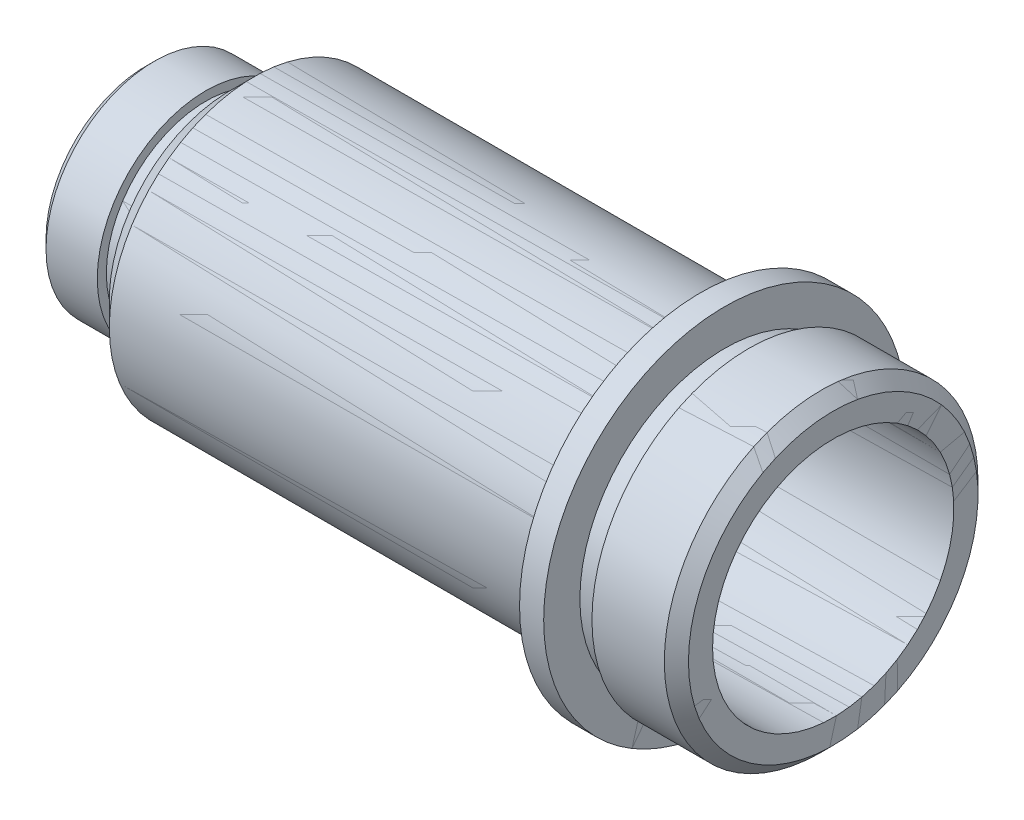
ISO-10303-21;
HEADER;
FILE_DESCRIPTION(('STEP AP214'),'2;1');
FILE_NAME('part.step','',(''),(''),'','','');
FILE_SCHEMA(('AUTOMOTIVE_DESIGN { 1 0 10303 214 1 1 1 1 }'));
ENDSEC;
DATA;
#1=APPLICATION_CONTEXT('core data for automotive mechanical design processes');
#2=APPLICATION_PROTOCOL_DEFINITION('international standard','automotive_design',2000,#1);
#3=PRODUCT_CONTEXT('',#1,'mechanical');
#4=PRODUCT('Part','Part','',(#3));
#5=PRODUCT_RELATED_PRODUCT_CATEGORY('part','',(#4));
#6=PRODUCT_DEFINITION_FORMATION('','',#4);
#7=PRODUCT_DEFINITION_CONTEXT('part definition',#1,'design');
#8=PRODUCT_DEFINITION('design','',#6,#7);
#9=PRODUCT_DEFINITION_SHAPE('','',#8);
#10=(LENGTH_UNIT() NAMED_UNIT(*) SI_UNIT(.MILLI.,.METRE.));
#11=(NAMED_UNIT(*) PLANE_ANGLE_UNIT() SI_UNIT($,.RADIAN.));
#12=(NAMED_UNIT(*) SI_UNIT($,.STERADIAN.) SOLID_ANGLE_UNIT());
#13=UNCERTAINTY_MEASURE_WITH_UNIT(LENGTH_MEASURE(1.E-05),#10,'distance_accuracy_value','');
#14=(GEOMETRIC_REPRESENTATION_CONTEXT(3) GLOBAL_UNCERTAINTY_ASSIGNED_CONTEXT((#13)) GLOBAL_UNIT_ASSIGNED_CONTEXT((#10,
#11,#12)) REPRESENTATION_CONTEXT('',''));
#15=CARTESIAN_POINT('',(0.,0.,0.));
#16=DIRECTION('',(0.,0.,1.));
#17=DIRECTION('',(1.,0.,0.));
#18=AXIS2_PLACEMENT_3D('',#15,#16,#17);
#19=CARTESIAN_POINT('',(-21.,0.,0.));
#20=DIRECTION('',(-1.,0.,0.));
#21=DIRECTION('',(0.,0.,1.));
#22=AXIS2_PLACEMENT_3D('',#19,#20,#21);
#23=CYLINDRICAL_SURFACE('',#22,7.49999999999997);
#24=CARTESIAN_POINT('',(-21.,0.,0.));
#25=DIRECTION('',(-1.,0.,0.));
#26=DIRECTION('',(0.,0.,1.));
#27=AXIS2_PLACEMENT_3D('',#24,#25,#26);
#28=CIRCLE('',#27,7.49999999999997);
#29=CARTESIAN_POINT('',(-21.,0.,7.49999999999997));
#30=VERTEX_POINT('',#29);
#31=EDGE_CURVE('P0_E434',#30,#30,#28,.F.);
#32=ORIENTED_EDGE('',*,*,#31,.F.);
#33=EDGE_LOOP('',(#32));
#34=FACE_BOUND('',#33,.T.);
#35=CARTESIAN_POINT('',(-22.,0.,0.));
#36=DIRECTION('',(-1.,0.,0.));
#37=DIRECTION('',(0.,0.,1.));
#38=AXIS2_PLACEMENT_3D('',#35,#36,#37);
#39=CIRCLE('',#38,7.49999999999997);
#40=CARTESIAN_POINT('',(-22.,0.,7.49999999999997));
#41=VERTEX_POINT('',#40);
#42=EDGE_CURVE('P0_E429',#41,#41,#39,.T.);
#43=ORIENTED_EDGE('',*,*,#42,.F.);
#44=EDGE_LOOP('',(#43));
#45=FACE_BOUND('',#44,.T.);
#46=ADVANCED_FACE('P0_F348',(#34,#45),#23,.T.);
#47=CARTESIAN_POINT('',(-21.,-1.6592380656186,-10.476016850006));
#48=DIRECTION('',(1.,0.,0.));
#49=DIRECTION('',(0.,0.809016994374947,0.587785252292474));
#50=AXIS2_PLACEMENT_3D('',#47,#48,#49);
#51=PLANE('',#50);
#52=CARTESIAN_POINT('',(-21.,0.,0.));
#53=DIRECTION('',(-1.,0.,0.));
#54=DIRECTION('',(0.,0.,1.));
#55=AXIS2_PLACEMENT_3D('',#52,#53,#54);
#56=CIRCLE('',#55,5.99999999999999);
#57=CARTESIAN_POINT('',(-21.,0.,5.99999999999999));
#58=VERTEX_POINT('',#57);
#59=EDGE_CURVE('P0_E424',#58,#58,#56,.T.);
#60=ORIENTED_EDGE('',*,*,#59,.T.);
#61=EDGE_LOOP('',(#60));
#62=FACE_BOUND('',#61,.T.);
#63=ORIENTED_EDGE('',*,*,#31,.T.);
#64=EDGE_LOOP('',(#63));
#65=FACE_BOUND('',#64,.T.);
#66=ADVANCED_FACE('P0_F439',(#62,#65),#51,.T.);
#67=CARTESIAN_POINT('',(-22.,-10.476016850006,1.6592380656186));
#68=DIRECTION('',(-1.,0.,0.));
#69=DIRECTION('',(0.,0.809016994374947,0.587785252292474));
#70=AXIS2_PLACEMENT_3D('',#67,#68,#69);
#71=PLANE('',#70);
#72=CARTESIAN_POINT('',(-22.,0.,0.));
#73=DIRECTION('',(-1.,0.,0.));
#74=DIRECTION('',(0.,0.,1.));
#75=AXIS2_PLACEMENT_3D('',#72,#73,#74);
#76=CIRCLE('',#75,5.99999999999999);
#77=CARTESIAN_POINT('',(-22.,0.,5.99999999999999));
#78=VERTEX_POINT('',#77);
#79=EDGE_CURVE('P0_E421',#78,#78,#76,.F.);
#80=ORIENTED_EDGE('',*,*,#79,.T.);
#81=EDGE_LOOP('',(#80));
#82=FACE_BOUND('',#81,.T.);
#83=ORIENTED_EDGE('',*,*,#42,.T.);
#84=EDGE_LOOP('',(#83));
#85=FACE_BOUND('',#84,.T.);
#86=ADVANCED_FACE('P0_F446',(#82,#85),#71,.T.);
#87=CARTESIAN_POINT('',(-20.,0.,0.));
#88=DIRECTION('',(-1.,0.,0.));
#89=DIRECTION('',(0.,0.,1.));
#90=AXIS2_PLACEMENT_3D('',#87,#88,#89);
#91=CYLINDRICAL_SURFACE('',#90,5.99999999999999);
#92=CARTESIAN_POINT('',(-20.,0.,0.));
#93=DIRECTION('',(-1.,0.,0.));
#94=DIRECTION('',(0.,0.,1.));
#95=AXIS2_PLACEMENT_3D('',#92,#93,#94);
#96=CIRCLE('',#95,5.99999999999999);
#97=CARTESIAN_POINT('',(-20.,0.,5.99999999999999));
#98=VERTEX_POINT('',#97);
#99=EDGE_CURVE('P0_E418',#98,#98,#96,.F.);
#100=ORIENTED_EDGE('',*,*,#99,.F.);
#101=EDGE_LOOP('',(#100));
#102=FACE_BOUND('',#101,.T.);
#103=ORIENTED_EDGE('',*,*,#59,.F.);
#104=EDGE_LOOP('',(#103));
#105=FACE_BOUND('',#104,.T.);
#106=ADVANCED_FACE('P0_F448',(#102,#105),#91,.T.);
#107=CARTESIAN_POINT('',(-22.,0.,0.));
#108=DIRECTION('',(-1.,0.,0.));
#109=DIRECTION('',(0.,0.,1.));
#110=AXIS2_PLACEMENT_3D('',#107,#108,#109);
#111=CYLINDRICAL_SURFACE('',#110,5.99999999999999);
#112=ORIENTED_EDGE('',*,*,#79,.F.);
#113=EDGE_LOOP('',(#112));
#114=FACE_BOUND('',#113,.T.);
#115=CARTESIAN_POINT('',(-40.5,0.,0.));
#116=DIRECTION('',(-1.,0.,0.));
#117=DIRECTION('',(0.,0.809016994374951,0.587785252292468));
#118=AXIS2_PLACEMENT_3D('',#115,#116,#117);
#119=CIRCLE('',#118,5.99999999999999);
#120=CARTESIAN_POINT('',(-40.5,4.8541019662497,3.5267115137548));
#121=VERTEX_POINT('',#120);
#122=EDGE_CURVE('P0_E417',#121,#121,#119,.F.);
#123=ORIENTED_EDGE('',*,*,#122,.T.);
#124=EDGE_LOOP('',(#123));
#125=FACE_BOUND('',#124,.T.);
#126=ADVANCED_FACE('P0_F455',(#114,#125),#111,.T.);
#127=CARTESIAN_POINT('',(-20.,-15.0086104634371,2.76461512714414));
#128=DIRECTION('',(-1.,0.,0.));
#129=DIRECTION('',(0.,0.809016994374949,0.587785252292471));
#130=AXIS2_PLACEMENT_3D('',#127,#128,#129);
#131=PLANE('',#130);
#132=ORIENTED_EDGE('',*,*,#99,.T.);
#133=EDGE_LOOP('',(#132));
#134=FACE_BOUND('',#133,.T.);
#135=CARTESIAN_POINT('',(-20.,0.,0.));
#136=DIRECTION('',(-1.,0.,0.));
#137=DIRECTION('',(0.,0.,1.));
#138=AXIS2_PLACEMENT_3D('',#135,#136,#137);
#139=CIRCLE('',#138,6.50000000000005);
#140=CARTESIAN_POINT('',(-20.,0.,6.50000000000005));
#141=VERTEX_POINT('',#140);
#142=EDGE_CURVE('P0_E412',#141,#141,#139,.T.);
#143=ORIENTED_EDGE('',*,*,#142,.T.);
#144=EDGE_LOOP('',(#143));
#145=FACE_BOUND('',#144,.T.);
#146=ADVANCED_FACE('P0_F506',(#134,#145),#131,.T.);
#147=CARTESIAN_POINT('',(-40.5,0.,0.));
#148=DIRECTION('',(1.,0.,0.));
#149=DIRECTION('',(0.,0.,-1.));
#150=AXIS2_PLACEMENT_3D('',#147,#148,#149);
#151=CONICAL_SURFACE('',#150,5.99999999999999,0.785398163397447);
#152=ORIENTED_EDGE('',*,*,#122,.F.);
#153=EDGE_LOOP('',(#152));
#154=FACE_BOUND('',#153,.T.);
#155=CARTESIAN_POINT('',(-41.5,0.,0.));
#156=DIRECTION('',(1.,0.,0.));
#157=DIRECTION('',(0.,0.,-1.));
#158=AXIS2_PLACEMENT_3D('',#155,#156,#157);
#159=CIRCLE('',#158,4.99999999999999);
#160=CARTESIAN_POINT('',(-41.5,0.,-4.99999999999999));
#161=VERTEX_POINT('',#160);
#162=EDGE_CURVE('P0_E409',#161,#161,#159,.F.);
#163=ORIENTED_EDGE('',*,*,#162,.F.);
#164=EDGE_LOOP('',(#163));
#165=FACE_BOUND('',#164,.T.);
#166=ADVANCED_FACE('P0_F502',(#154,#165),#151,.T.);
#167=CARTESIAN_POINT('',(-17.,0.,0.));
#168=DIRECTION('',(-1.,0.,0.));
#169=DIRECTION('',(0.,0.,1.));
#170=AXIS2_PLACEMENT_3D('',#167,#168,#169);
#171=CYLINDRICAL_SURFACE('',#170,6.50000000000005);
#172=CARTESIAN_POINT('',(-17.,0.,0.));
#173=DIRECTION('',(-1.,0.,0.));
#174=DIRECTION('',(0.,0.809016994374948,0.587785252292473));
#175=AXIS2_PLACEMENT_3D('',#172,#173,#174);
#176=CIRCLE('',#175,6.50000000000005);
#177=CARTESIAN_POINT('',(-17.,5.2586104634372,3.8206041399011));
#178=VERTEX_POINT('',#177);
#179=EDGE_CURVE('P0_E406',#178,#178,#176,.T.);
#180=ORIENTED_EDGE('',*,*,#179,.T.);
#181=EDGE_LOOP('',(#180));
#182=FACE_BOUND('',#181,.T.);
#183=ORIENTED_EDGE('',*,*,#142,.F.);
#184=EDGE_LOOP('',(#183));
#185=FACE_BOUND('',#184,.T.);
#186=ADVANCED_FACE('P0_F499',(#182,#185),#171,.T.);
#187=CARTESIAN_POINT('',(-41.5,-6.9840112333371,1.1061587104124));
#188=DIRECTION('',(-1.,0.,0.));
#189=DIRECTION('',(0.,0.80901699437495,0.58778525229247));
#190=AXIS2_PLACEMENT_3D('',#187,#188,#189);
#191=PLANE('',#190);
#192=CARTESIAN_POINT('',(-41.5,0.,0.));
#193=DIRECTION('',(-1.,0.,0.));
#194=DIRECTION('',(0.,0.,1.));
#195=AXIS2_PLACEMENT_3D('',#192,#193,#194);
#196=CIRCLE('',#195,4.12500000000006);
#197=CARTESIAN_POINT('',(-41.5,0.,4.12500000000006));
#198=VERTEX_POINT('',#197);
#199=EDGE_CURVE('P0_E403',#198,#198,#196,.F.);
#200=ORIENTED_EDGE('',*,*,#199,.T.);
#201=EDGE_LOOP('',(#200));
#202=FACE_BOUND('',#201,.T.);
#203=ORIENTED_EDGE('',*,*,#162,.T.);
#204=EDGE_LOOP('',(#203));
#205=FACE_BOUND('',#204,.T.);
#206=ADVANCED_FACE('P0_F497',(#202,#205),#191,.T.);
#207=CARTESIAN_POINT('',(-16.5,0.,0.));
#208=DIRECTION('',(-1.,0.,0.));
#209=DIRECTION('',(0.,0.,1.));
#210=AXIS2_PLACEMENT_3D('',#207,#208,#209);
#211=CONICAL_SURFACE('',#210,5.99999999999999,0.785398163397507);
#212=CARTESIAN_POINT('',(-16.5,0.,0.));
#213=DIRECTION('',(-1.,0.,0.));
#214=DIRECTION('',(0.,0.,1.));
#215=AXIS2_PLACEMENT_3D('',#212,#213,#214);
#216=CIRCLE('',#215,5.99999999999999);
#217=CARTESIAN_POINT('',(-16.5,0.,5.99999999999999));
#218=VERTEX_POINT('',#217);
#219=EDGE_CURVE('P0_E400',#218,#218,#216,.F.);
#220=ORIENTED_EDGE('',*,*,#219,.F.);
#221=EDGE_LOOP('',(#220));
#222=FACE_BOUND('',#221,.T.);
#223=ORIENTED_EDGE('',*,*,#179,.F.);
#224=EDGE_LOOP('',(#223));
#225=FACE_BOUND('',#224,.T.);
#226=ADVANCED_FACE('P0_F493',(#222,#225),#211,.T.);
#227=CARTESIAN_POINT('',(-41.5,0.,0.));
#228=DIRECTION('',(-1.,0.,0.));
#229=DIRECTION('',(0.,0.,1.));
#230=AXIS2_PLACEMENT_3D('',#227,#228,#229);
#231=CYLINDRICAL_SURFACE('',#230,4.12500000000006);
#232=ORIENTED_EDGE('',*,*,#199,.F.);
#233=EDGE_LOOP('',(#232));
#234=FACE_BOUND('',#233,.T.);
#235=CARTESIAN_POINT('',(-42.5,0.,0.));
#236=DIRECTION('',(-1.,0.,0.));
#237=DIRECTION('',(0.,0.,1.));
#238=AXIS2_PLACEMENT_3D('',#235,#236,#237);
#239=CIRCLE('',#238,4.12500000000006);
#240=CARTESIAN_POINT('',(-42.5,0.,4.12500000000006));
#241=VERTEX_POINT('',#240);
#242=EDGE_CURVE('P0_E395',#241,#241,#239,.T.);
#243=ORIENTED_EDGE('',*,*,#242,.F.);
#244=EDGE_LOOP('',(#243));
#245=FACE_BOUND('',#244,.T.);
#246=ADVANCED_FACE('P0_F489',(#234,#245),#231,.T.);
#247=CARTESIAN_POINT('',(-16.5,-2.99999999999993,-12.3874372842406));
#248=DIRECTION('',(1.,0.,0.));
#249=DIRECTION('',(0.,0.809016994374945,0.587785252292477));
#250=AXIS2_PLACEMENT_3D('',#247,#248,#249);
#251=PLANE('',#250);
#252=CARTESIAN_POINT('',(-16.5,0.,0.));
#253=DIRECTION('',(-1.,0.,0.));
#254=DIRECTION('',(0.,0.,1.));
#255=AXIS2_PLACEMENT_3D('',#252,#253,#254);
#256=CIRCLE('',#255,4.99999999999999);
#257=CARTESIAN_POINT('',(-16.5,0.,4.99999999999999));
#258=VERTEX_POINT('',#257);
#259=EDGE_CURVE('P0_E392',#258,#258,#256,.F.);
#260=ORIENTED_EDGE('',*,*,#259,.F.);
#261=EDGE_LOOP('',(#260));
#262=FACE_BOUND('',#261,.T.);
#263=ORIENTED_EDGE('',*,*,#219,.T.);
#264=EDGE_LOOP('',(#263));
#265=FACE_BOUND('',#264,.T.);
#266=ADVANCED_FACE('P0_F492',(#262,#265),#251,.T.);
#267=CARTESIAN_POINT('',(-42.5,-1.39057647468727,-10.4734729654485));
#268=DIRECTION('',(1.,0.,0.));
#269=DIRECTION('',(0.,0.809016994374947,0.587785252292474));
#270=AXIS2_PLACEMENT_3D('',#267,#268,#269);
#271=PLANE('',#270);
#272=ORIENTED_EDGE('',*,*,#242,.T.);
#273=EDGE_LOOP('',(#272));
#274=FACE_BOUND('',#273,.T.);
#275=CARTESIAN_POINT('',(-42.5,0.,0.));
#276=DIRECTION('',(-1.,0.,0.));
#277=DIRECTION('',(0.,0.,1.));
#278=AXIS2_PLACEMENT_3D('',#275,#276,#277);
#279=CIRCLE('',#278,4.50000000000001);
#280=CARTESIAN_POINT('',(-42.5,0.,4.50000000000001));
#281=VERTEX_POINT('',#280);
#282=EDGE_CURVE('P0_E387',#281,#281,#279,.F.);
#283=ORIENTED_EDGE('',*,*,#282,.T.);
#284=EDGE_LOOP('',(#283));
#285=FACE_BOUND('',#284,.T.);
#286=ADVANCED_FACE('P0_F487',(#274,#285),#271,.T.);
#287=CARTESIAN_POINT('',(-16.5,0.,0.));
#288=DIRECTION('',(-1.,0.,0.));
#289=DIRECTION('',(0.,0.,1.));
#290=AXIS2_PLACEMENT_3D('',#287,#288,#289);
#291=CYLINDRICAL_SURFACE('',#290,4.99999999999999);
#292=CARTESIAN_POINT('',(-40.5,0.,0.));
#293=DIRECTION('',(-1.,0.,0.));
#294=DIRECTION('',(0.,0.,1.));
#295=AXIS2_PLACEMENT_3D('',#292,#293,#294);
#296=CIRCLE('',#295,4.99999999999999);
#297=CARTESIAN_POINT('',(-40.5,0.,4.99999999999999));
#298=VERTEX_POINT('',#297);
#299=EDGE_CURVE('P0_E384',#298,#298,#296,.F.);
#300=ORIENTED_EDGE('',*,*,#299,.F.);
#301=EDGE_LOOP('',(#300));
#302=FACE_BOUND('',#301,.T.);
#303=ORIENTED_EDGE('',*,*,#259,.T.);
#304=EDGE_LOOP('',(#303));
#305=FACE_BOUND('',#304,.T.);
#306=ADVANCED_FACE('P0_F483',(#302,#305),#291,.F.);
#307=CARTESIAN_POINT('',(-42.5,0.,0.));
#308=DIRECTION('',(-1.,0.,0.));
#309=DIRECTION('',(0.,0.,1.));
#310=AXIS2_PLACEMENT_3D('',#307,#308,#309);
#311=CYLINDRICAL_SURFACE('',#310,4.50000000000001);
#312=ORIENTED_EDGE('',*,*,#282,.F.);
#313=EDGE_LOOP('',(#312));
#314=FACE_BOUND('',#313,.T.);
#315=CARTESIAN_POINT('',(-44.625,0.,0.));
#316=DIRECTION('',(-1.,0.,0.));
#317=DIRECTION('',(0.,0.809016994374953,0.587785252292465));
#318=AXIS2_PLACEMENT_3D('',#315,#316,#317);
#319=CIRCLE('',#318,4.50000000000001);
#320=CARTESIAN_POINT('',(-44.625,3.6405764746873,2.6450336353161));
#321=VERTEX_POINT('',#320);
#322=EDGE_CURVE('P0_E381',#321,#321,#319,.F.);
#323=ORIENTED_EDGE('',*,*,#322,.T.);
#324=EDGE_LOOP('',(#323));
#325=FACE_BOUND('',#324,.T.);
#326=ADVANCED_FACE('P0_F480',(#314,#325),#311,.T.);
#327=CARTESIAN_POINT('',(-40.5,-1.1061587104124,-6.9840112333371));
#328=DIRECTION('',(1.,0.,0.));
#329=DIRECTION('',(0.,0.80901699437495,0.58778525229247));
#330=AXIS2_PLACEMENT_3D('',#327,#328,#329);
#331=PLANE('',#330);
#332=CARTESIAN_POINT('',(-40.5,0.,0.));
#333=DIRECTION('',(-1.,0.,0.));
#334=DIRECTION('',(0.,0.,1.));
#335=AXIS2_PLACEMENT_3D('',#332,#333,#334);
#336=CIRCLE('',#335,1.49999999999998);
#337=CARTESIAN_POINT('',(-40.5,0.,1.49999999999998));
#338=VERTEX_POINT('',#337);
#339=EDGE_CURVE('P0_E378',#338,#338,#336,.F.);
#340=ORIENTED_EDGE('',*,*,#339,.F.);
#341=EDGE_LOOP('',(#340));
#342=FACE_BOUND('',#341,.T.);
#343=ORIENTED_EDGE('',*,*,#299,.T.);
#344=EDGE_LOOP('',(#343));
#345=FACE_BOUND('',#344,.T.);
#346=ADVANCED_FACE('P0_F478',(#342,#345),#331,.T.);
#347=CARTESIAN_POINT('',(-44.625,0.,0.));
#348=DIRECTION('',(1.,0.,0.));
#349=DIRECTION('',(0.,0.,-1.));
#350=AXIS2_PLACEMENT_3D('',#347,#348,#349);
#351=CONICAL_SURFACE('',#350,4.50000000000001,0.78539816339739);
#352=ORIENTED_EDGE('',*,*,#322,.F.);
#353=EDGE_LOOP('',(#352));
#354=FACE_BOUND('',#353,.T.);
#355=CARTESIAN_POINT('',(-45.,0.,0.));
#356=DIRECTION('',(1.,0.,0.));
#357=DIRECTION('',(0.,0.,-1.));
#358=AXIS2_PLACEMENT_3D('',#355,#356,#357);
#359=CIRCLE('',#358,4.12500000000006);
#360=CARTESIAN_POINT('',(-45.,0.,-4.12500000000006));
#361=VERTEX_POINT('',#360);
#362=EDGE_CURVE('P0_E373',#361,#361,#359,.F.);
#363=ORIENTED_EDGE('',*,*,#362,.F.);
#364=EDGE_LOOP('',(#363));
#365=FACE_BOUND('',#364,.T.);
#366=ADVANCED_FACE('P0_F474',(#354,#365),#351,.T.);
#367=CARTESIAN_POINT('',(-40.5,0.,0.));
#368=DIRECTION('',(-1.,0.,0.));
#369=DIRECTION('',(0.,0.,1.));
#370=AXIS2_PLACEMENT_3D('',#367,#368,#369);
#371=CYLINDRICAL_SURFACE('',#370,1.49999999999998);
#372=CARTESIAN_POINT('',(-41.5,0.,0.));
#373=DIRECTION('',(-1.,0.,0.));
#374=DIRECTION('',(0.,0.,1.));
#375=AXIS2_PLACEMENT_3D('',#372,#373,#374);
#376=CIRCLE('',#375,1.49999999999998);
#377=CARTESIAN_POINT('',(-41.5,0.,1.49999999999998));
#378=VERTEX_POINT('',#377);
#379=EDGE_CURVE('P0_E361',#378,#378,#376,.F.);
#380=ORIENTED_EDGE('',*,*,#379,.F.);
#381=EDGE_LOOP('',(#380));
#382=FACE_BOUND('',#381,.T.);
#383=ORIENTED_EDGE('',*,*,#339,.T.);
#384=EDGE_LOOP('',(#383));
#385=FACE_BOUND('',#384,.T.);
#386=ADVANCED_FACE('P0_F471',(#382,#385),#371,.F.);
#387=CARTESIAN_POINT('',(-45.,-8.73689020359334,0.670146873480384));
#388=DIRECTION('',(-1.,0.,0.));
#389=DIRECTION('',(0.,0.809016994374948,0.587785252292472));
#390=AXIS2_PLACEMENT_3D('',#387,#388,#389);
#391=PLANE('',#390);
#392=CARTESIAN_POINT('',(-45.,0.,0.));
#393=DIRECTION('',(-1.,0.,0.));
#394=DIRECTION('',(0.,0.,1.));
#395=AXIS2_PLACEMENT_3D('',#392,#393,#394);
#396=CIRCLE('',#395,3.24999999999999);
#397=CARTESIAN_POINT('',(-45.,0.,3.24999999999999));
#398=VERTEX_POINT('',#397);
#399=EDGE_CURVE('P0_E356',#398,#398,#396,.T.);
#400=ORIENTED_EDGE('',*,*,#399,.F.);
#401=EDGE_LOOP('',(#400));
#402=FACE_BOUND('',#401,.T.);
#403=ORIENTED_EDGE('',*,*,#362,.T.);
#404=EDGE_LOOP('',(#403));
#405=FACE_BOUND('',#404,.T.);
#406=ADVANCED_FACE('P0_F468',(#402,#405),#391,.T.);
#407=CARTESIAN_POINT('',(-41.5,-4.5396073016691,0.71900316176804));
#408=DIRECTION('',(-1.,0.,0.));
#409=DIRECTION('',(0.,0.809016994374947,0.587785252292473));
#410=AXIS2_PLACEMENT_3D('',#407,#408,#409);
#411=PLANE('',#410);
#412=ORIENTED_EDGE('',*,*,#379,.T.);
#413=EDGE_LOOP('',(#412));
#414=FACE_BOUND('',#413,.T.);
#415=CARTESIAN_POINT('',(-41.5,0.,0.));
#416=DIRECTION('',(-1.,0.,0.));
#417=DIRECTION('',(0.,0.,1.));
#418=AXIS2_PLACEMENT_3D('',#415,#416,#417);
#419=CIRCLE('',#418,3.24999999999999);
#420=CARTESIAN_POINT('',(-41.5,0.,3.24999999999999));
#421=VERTEX_POINT('',#420);
#422=EDGE_CURVE('P0_E10',#421,#421,#419,.F.);
#423=ORIENTED_EDGE('',*,*,#422,.F.);
#424=EDGE_LOOP('',(#423));
#425=FACE_BOUND('',#424,.T.);
#426=ADVANCED_FACE('P0_F350',(#414,#425),#411,.T.);
#427=CARTESIAN_POINT('',(-41.5,0.,0.));
#428=DIRECTION('',(-1.,0.,0.));
#429=DIRECTION('',(0.,0.,1.));
#430=AXIS2_PLACEMENT_3D('',#427,#428,#429);
#431=CYLINDRICAL_SURFACE('',#430,3.24999999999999);
#432=ORIENTED_EDGE('',*,*,#399,.T.);
#433=EDGE_LOOP('',(#432));
#434=FACE_BOUND('',#433,.T.);
#435=ORIENTED_EDGE('',*,*,#422,.T.);
#436=EDGE_LOOP('',(#435));
#437=FACE_BOUND('',#436,.T.);
#438=ADVANCED_FACE('P0_F461',(#434,#437),#431,.F.);
#439=CLOSED_SHELL('',(#46,#66,#86,#106,#126,#146,#166,#186,#206,#226,#246,#266,#286,#306,#326,
#346,#366,#386,#406,#426,#438));
#440=MANIFOLD_SOLID_BREP('P0_B2',#439);
#441=CARTESIAN_POINT('',(-21.,0.,0.));
#442=DIRECTION('',(-1.,0.,0.));
#443=DIRECTION('',(0.,0.,1.));
#444=AXIS2_PLACEMENT_3D('',#441,#442,#443);
#445=CYLINDRICAL_SURFACE('',#444,7.49999999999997);
#446=CARTESIAN_POINT('',(-21.,0.,0.));
#447=DIRECTION('',(-1.,0.,0.));
#448=DIRECTION('',(0.,0.,1.));
#449=AXIS2_PLACEMENT_3D('',#446,#447,#448);
#450=CIRCLE('',#449,7.49999999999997);
#451=CARTESIAN_POINT('',(-21.,0.,7.49999999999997));
#452=VERTEX_POINT('',#451);
#453=EDGE_CURVE('P1_E100',#452,#452,#450,.F.);
#454=ORIENTED_EDGE('',*,*,#453,.F.);
#455=EDGE_LOOP('',(#454));
#456=FACE_BOUND('',#455,.T.);
#457=CARTESIAN_POINT('',(-22.,0.,0.));
#458=DIRECTION('',(-1.,0.,0.));
#459=DIRECTION('',(0.,0.,1.));
#460=AXIS2_PLACEMENT_3D('',#457,#458,#459);
#461=CIRCLE('',#460,7.49999999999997);
#462=CARTESIAN_POINT('',(-22.,0.,7.49999999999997));
#463=VERTEX_POINT('',#462);
#464=EDGE_CURVE('P1_E95',#463,#463,#461,.T.);
#465=ORIENTED_EDGE('',*,*,#464,.F.);
#466=EDGE_LOOP('',(#465));
#467=FACE_BOUND('',#466,.T.);
#468=ADVANCED_FACE('P1_F14',(#456,#467),#445,.T.);
#469=CARTESIAN_POINT('',(-21.,-1.6592380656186,-10.476016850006));
#470=DIRECTION('',(1.,0.,0.));
#471=DIRECTION('',(0.,0.809016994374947,0.587785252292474));
#472=AXIS2_PLACEMENT_3D('',#469,#470,#471);
#473=PLANE('',#472);
#474=CARTESIAN_POINT('',(-21.,0.,0.));
#475=DIRECTION('',(-1.,0.,0.));
#476=DIRECTION('',(0.,0.,1.));
#477=AXIS2_PLACEMENT_3D('',#474,#475,#476);
#478=CIRCLE('',#477,5.99999999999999);
#479=CARTESIAN_POINT('',(-21.,0.,5.99999999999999));
#480=VERTEX_POINT('',#479);
#481=EDGE_CURVE('P1_E90',#480,#480,#478,.T.);
#482=ORIENTED_EDGE('',*,*,#481,.T.);
#483=EDGE_LOOP('',(#482));
#484=FACE_BOUND('',#483,.T.);
#485=ORIENTED_EDGE('',*,*,#453,.T.);
#486=EDGE_LOOP('',(#485));
#487=FACE_BOUND('',#486,.T.);
#488=ADVANCED_FACE('P1_F105',(#484,#487),#473,.T.);
#489=CARTESIAN_POINT('',(-22.,-10.476016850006,1.6592380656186));
#490=DIRECTION('',(-1.,0.,0.));
#491=DIRECTION('',(0.,0.809016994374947,0.587785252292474));
#492=AXIS2_PLACEMENT_3D('',#489,#490,#491);
#493=PLANE('',#492);
#494=CARTESIAN_POINT('',(-22.,0.,0.));
#495=DIRECTION('',(-1.,0.,0.));
#496=DIRECTION('',(0.,0.,1.));
#497=AXIS2_PLACEMENT_3D('',#494,#495,#496);
#498=CIRCLE('',#497,5.99999999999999);
#499=CARTESIAN_POINT('',(-22.,0.,5.99999999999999));
#500=VERTEX_POINT('',#499);
#501=EDGE_CURVE('P1_E87',#500,#500,#498,.F.);
#502=ORIENTED_EDGE('',*,*,#501,.T.);
#503=EDGE_LOOP('',(#502));
#504=FACE_BOUND('',#503,.T.);
#505=ORIENTED_EDGE('',*,*,#464,.T.);
#506=EDGE_LOOP('',(#505));
#507=FACE_BOUND('',#506,.T.);
#508=ADVANCED_FACE('P1_F111',(#504,#507),#493,.T.);
#509=CARTESIAN_POINT('',(-20.,0.,0.));
#510=DIRECTION('',(-1.,0.,0.));
#511=DIRECTION('',(0.,0.,1.));
#512=AXIS2_PLACEMENT_3D('',#509,#510,#511);
#513=CYLINDRICAL_SURFACE('',#512,5.99999999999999);
#514=CARTESIAN_POINT('',(-20.,0.,0.));
#515=DIRECTION('',(-1.,0.,0.));
#516=DIRECTION('',(0.,0.,1.));
#517=AXIS2_PLACEMENT_3D('',#514,#515,#516);
#518=CIRCLE('',#517,5.99999999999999);
#519=CARTESIAN_POINT('',(-20.,0.,5.99999999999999));
#520=VERTEX_POINT('',#519);
#521=EDGE_CURVE('P1_E84',#520,#520,#518,.F.);
#522=ORIENTED_EDGE('',*,*,#521,.F.);
#523=EDGE_LOOP('',(#522));
#524=FACE_BOUND('',#523,.T.);
#525=ORIENTED_EDGE('',*,*,#481,.F.);
#526=EDGE_LOOP('',(#525));
#527=FACE_BOUND('',#526,.T.);
#528=ADVANCED_FACE('P1_F112',(#524,#527),#513,.T.);
#529=CARTESIAN_POINT('',(-22.,0.,0.));
#530=DIRECTION('',(-1.,0.,0.));
#531=DIRECTION('',(0.,0.,1.));
#532=AXIS2_PLACEMENT_3D('',#529,#530,#531);
#533=CYLINDRICAL_SURFACE('',#532,5.99999999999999);
#534=ORIENTED_EDGE('',*,*,#501,.F.);
#535=EDGE_LOOP('',(#534));
#536=FACE_BOUND('',#535,.T.);
#537=CARTESIAN_POINT('',(-40.5,0.,0.));
#538=DIRECTION('',(-1.,0.,0.));
#539=DIRECTION('',(0.,0.809016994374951,0.587785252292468));
#540=AXIS2_PLACEMENT_3D('',#537,#538,#539);
#541=CIRCLE('',#540,5.99999999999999);
#542=CARTESIAN_POINT('',(-40.5,4.8541019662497,3.5267115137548));
#543=VERTEX_POINT('',#542);
#544=EDGE_CURVE('P1_E83',#543,#543,#541,.F.);
#545=ORIENTED_EDGE('',*,*,#544,.T.);
#546=EDGE_LOOP('',(#545));
#547=FACE_BOUND('',#546,.T.);
#548=ADVANCED_FACE('P1_F115',(#536,#547),#533,.T.);
#549=CARTESIAN_POINT('',(-20.,-15.0086104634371,2.76461512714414));
#550=DIRECTION('',(-1.,0.,0.));
#551=DIRECTION('',(0.,0.809016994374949,0.587785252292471));
#552=AXIS2_PLACEMENT_3D('',#549,#550,#551);
#553=PLANE('',#552);
#554=ORIENTED_EDGE('',*,*,#521,.T.);
#555=EDGE_LOOP('',(#554));
#556=FACE_BOUND('',#555,.T.);
#557=CARTESIAN_POINT('',(-20.,0.,0.));
#558=DIRECTION('',(-1.,0.,0.));
#559=DIRECTION('',(0.,0.,1.));
#560=AXIS2_PLACEMENT_3D('',#557,#558,#559);
#561=CIRCLE('',#560,6.50000000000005);
#562=CARTESIAN_POINT('',(-20.,0.,6.50000000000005));
#563=VERTEX_POINT('',#562);
#564=EDGE_CURVE('P1_E78',#563,#563,#561,.T.);
#565=ORIENTED_EDGE('',*,*,#564,.T.);
#566=EDGE_LOOP('',(#565));
#567=FACE_BOUND('',#566,.T.);
#568=ADVANCED_FACE('P1_F154',(#556,#567),#553,.T.);
#569=CARTESIAN_POINT('',(-40.5,0.,0.));
#570=DIRECTION('',(1.,0.,0.));
#571=DIRECTION('',(0.,0.,-1.));
#572=AXIS2_PLACEMENT_3D('',#569,#570,#571);
#573=CONICAL_SURFACE('',#572,5.99999999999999,0.785398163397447);
#574=ORIENTED_EDGE('',*,*,#544,.F.);
#575=EDGE_LOOP('',(#574));
#576=FACE_BOUND('',#575,.T.);
#577=CARTESIAN_POINT('',(-41.5,0.,0.));
#578=DIRECTION('',(1.,0.,0.));
#579=DIRECTION('',(0.,0.,-1.));
#580=AXIS2_PLACEMENT_3D('',#577,#578,#579);
#581=CIRCLE('',#580,4.99999999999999);
#582=CARTESIAN_POINT('',(-41.5,0.,-4.99999999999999));
#583=VERTEX_POINT('',#582);
#584=EDGE_CURVE('P1_E75',#583,#583,#581,.F.);
#585=ORIENTED_EDGE('',*,*,#584,.F.);
#586=EDGE_LOOP('',(#585));
#587=FACE_BOUND('',#586,.T.);
#588=ADVANCED_FACE('P1_F151',(#576,#587),#573,.T.);
#589=CARTESIAN_POINT('',(-17.,0.,0.));
#590=DIRECTION('',(-1.,0.,0.));
#591=DIRECTION('',(0.,0.,1.));
#592=AXIS2_PLACEMENT_3D('',#589,#590,#591);
#593=CYLINDRICAL_SURFACE('',#592,6.50000000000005);
#594=CARTESIAN_POINT('',(-17.,0.,0.));
#595=DIRECTION('',(-1.,0.,0.));
#596=DIRECTION('',(0.,0.809016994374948,0.587785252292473));
#597=AXIS2_PLACEMENT_3D('',#594,#595,#596);
#598=CIRCLE('',#597,6.50000000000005);
#599=CARTESIAN_POINT('',(-17.,5.2586104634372,3.8206041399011));
#600=VERTEX_POINT('',#599);
#601=EDGE_CURVE('P1_E72',#600,#600,#598,.T.);
#602=ORIENTED_EDGE('',*,*,#601,.T.);
#603=EDGE_LOOP('',(#602));
#604=FACE_BOUND('',#603,.T.);
#605=ORIENTED_EDGE('',*,*,#564,.F.);
#606=EDGE_LOOP('',(#605));
#607=FACE_BOUND('',#606,.T.);
#608=ADVANCED_FACE('P1_F149',(#604,#607),#593,.T.);
#609=CARTESIAN_POINT('',(-41.5,-6.9840112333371,1.1061587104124));
#610=DIRECTION('',(-1.,0.,0.));
#611=DIRECTION('',(0.,0.80901699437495,0.58778525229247));
#612=AXIS2_PLACEMENT_3D('',#609,#610,#611);
#613=PLANE('',#612);
#614=CARTESIAN_POINT('',(-41.5,0.,0.));
#615=DIRECTION('',(-1.,0.,0.));
#616=DIRECTION('',(0.,0.,1.));
#617=AXIS2_PLACEMENT_3D('',#614,#615,#616);
#618=CIRCLE('',#617,4.12500000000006);
#619=CARTESIAN_POINT('',(-41.5,0.,4.12500000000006));
#620=VERTEX_POINT('',#619);
#621=EDGE_CURVE('P1_E69',#620,#620,#618,.F.);
#622=ORIENTED_EDGE('',*,*,#621,.T.);
#623=EDGE_LOOP('',(#622));
#624=FACE_BOUND('',#623,.T.);
#625=ORIENTED_EDGE('',*,*,#584,.T.);
#626=EDGE_LOOP('',(#625));
#627=FACE_BOUND('',#626,.T.);
#628=ADVANCED_FACE('P1_F147',(#624,#627),#613,.T.);
#629=CARTESIAN_POINT('',(-16.5,0.,0.));
#630=DIRECTION('',(-1.,0.,0.));
#631=DIRECTION('',(0.,0.,1.));
#632=AXIS2_PLACEMENT_3D('',#629,#630,#631);
#633=CONICAL_SURFACE('',#632,5.99999999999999,0.785398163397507);
#634=CARTESIAN_POINT('',(-16.5,0.,0.));
#635=DIRECTION('',(-1.,0.,0.));
#636=DIRECTION('',(0.,0.,1.));
#637=AXIS2_PLACEMENT_3D('',#634,#635,#636);
#638=CIRCLE('',#637,5.99999999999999);
#639=CARTESIAN_POINT('',(-16.5,0.,5.99999999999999));
#640=VERTEX_POINT('',#639);
#641=EDGE_CURVE('P1_E66',#640,#640,#638,.F.);
#642=ORIENTED_EDGE('',*,*,#641,.F.);
#643=EDGE_LOOP('',(#642));
#644=FACE_BOUND('',#643,.T.);
#645=ORIENTED_EDGE('',*,*,#601,.F.);
#646=EDGE_LOOP('',(#645));
#647=FACE_BOUND('',#646,.T.);
#648=ADVANCED_FACE('P1_F144',(#644,#647),#633,.T.);
#649=CARTESIAN_POINT('',(-41.5,0.,0.));
#650=DIRECTION('',(-1.,0.,0.));
#651=DIRECTION('',(0.,0.,1.));
#652=AXIS2_PLACEMENT_3D('',#649,#650,#651);
#653=CYLINDRICAL_SURFACE('',#652,4.12500000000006);
#654=ORIENTED_EDGE('',*,*,#621,.F.);
#655=EDGE_LOOP('',(#654));
#656=FACE_BOUND('',#655,.T.);
#657=CARTESIAN_POINT('',(-42.5,0.,0.));
#658=DIRECTION('',(-1.,0.,0.));
#659=DIRECTION('',(0.,0.,1.));
#660=AXIS2_PLACEMENT_3D('',#657,#658,#659);
#661=CIRCLE('',#660,4.12500000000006);
#662=CARTESIAN_POINT('',(-42.5,0.,4.12500000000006));
#663=VERTEX_POINT('',#662);
#664=EDGE_CURVE('P1_E61',#663,#663,#661,.T.);
#665=ORIENTED_EDGE('',*,*,#664,.F.);
#666=EDGE_LOOP('',(#665));
#667=FACE_BOUND('',#666,.T.);
#668=ADVANCED_FACE('P1_F141',(#656,#667),#653,.T.);
#669=CARTESIAN_POINT('',(-16.5,-2.99999999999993,-12.3874372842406));
#670=DIRECTION('',(1.,0.,0.));
#671=DIRECTION('',(0.,0.809016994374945,0.587785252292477));
#672=AXIS2_PLACEMENT_3D('',#669,#670,#671);
#673=PLANE('',#672);
#674=CARTESIAN_POINT('',(-16.5,0.,0.));
#675=DIRECTION('',(-1.,0.,0.));
#676=DIRECTION('',(0.,0.,1.));
#677=AXIS2_PLACEMENT_3D('',#674,#675,#676);
#678=CIRCLE('',#677,4.99999999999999);
#679=CARTESIAN_POINT('',(-16.5,0.,4.99999999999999));
#680=VERTEX_POINT('',#679);
#681=EDGE_CURVE('P1_E58',#680,#680,#678,.F.);
#682=ORIENTED_EDGE('',*,*,#681,.F.);
#683=EDGE_LOOP('',(#682));
#684=FACE_BOUND('',#683,.T.);
#685=ORIENTED_EDGE('',*,*,#641,.T.);
#686=EDGE_LOOP('',(#685));
#687=FACE_BOUND('',#686,.T.);
#688=ADVANCED_FACE('P1_F143',(#684,#687),#673,.T.);
#689=CARTESIAN_POINT('',(-42.5,-1.39057647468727,-10.4734729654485));
#690=DIRECTION('',(1.,0.,0.));
#691=DIRECTION('',(0.,0.809016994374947,0.587785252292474));
#692=AXIS2_PLACEMENT_3D('',#689,#690,#691);
#693=PLANE('',#692);
#694=ORIENTED_EDGE('',*,*,#664,.T.);
#695=EDGE_LOOP('',(#694));
#696=FACE_BOUND('',#695,.T.);
#697=CARTESIAN_POINT('',(-42.5,0.,0.));
#698=DIRECTION('',(-1.,0.,0.));
#699=DIRECTION('',(0.,0.,1.));
#700=AXIS2_PLACEMENT_3D('',#697,#698,#699);
#701=CIRCLE('',#700,4.50000000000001);
#702=CARTESIAN_POINT('',(-42.5,0.,4.50000000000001));
#703=VERTEX_POINT('',#702);
#704=EDGE_CURVE('P1_E53',#703,#703,#701,.F.);
#705=ORIENTED_EDGE('',*,*,#704,.T.);
#706=EDGE_LOOP('',(#705));
#707=FACE_BOUND('',#706,.T.);
#708=ADVANCED_FACE('P1_F139',(#696,#707),#693,.T.);
#709=CARTESIAN_POINT('',(-16.5,0.,0.));
#710=DIRECTION('',(-1.,0.,0.));
#711=DIRECTION('',(0.,0.,1.));
#712=AXIS2_PLACEMENT_3D('',#709,#710,#711);
#713=CYLINDRICAL_SURFACE('',#712,4.99999999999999);
#714=CARTESIAN_POINT('',(-40.5,0.,0.));
#715=DIRECTION('',(-1.,0.,0.));
#716=DIRECTION('',(0.,0.,1.));
#717=AXIS2_PLACEMENT_3D('',#714,#715,#716);
#718=CIRCLE('',#717,4.99999999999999);
#719=CARTESIAN_POINT('',(-40.5,0.,4.99999999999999));
#720=VERTEX_POINT('',#719);
#721=EDGE_CURVE('P1_E50',#720,#720,#718,.F.);
#722=ORIENTED_EDGE('',*,*,#721,.F.);
#723=EDGE_LOOP('',(#722));
#724=FACE_BOUND('',#723,.T.);
#725=ORIENTED_EDGE('',*,*,#681,.T.);
#726=EDGE_LOOP('',(#725));
#727=FACE_BOUND('',#726,.T.);
#728=ADVANCED_FACE('P1_F136',(#724,#727),#713,.F.);
#729=CARTESIAN_POINT('',(-42.5,0.,0.));
#730=DIRECTION('',(-1.,0.,0.));
#731=DIRECTION('',(0.,0.,1.));
#732=AXIS2_PLACEMENT_3D('',#729,#730,#731);
#733=CYLINDRICAL_SURFACE('',#732,4.50000000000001);
#734=ORIENTED_EDGE('',*,*,#704,.F.);
#735=EDGE_LOOP('',(#734));
#736=FACE_BOUND('',#735,.T.);
#737=CARTESIAN_POINT('',(-44.625,0.,0.));
#738=DIRECTION('',(-1.,0.,0.));
#739=DIRECTION('',(0.,0.809016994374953,0.587785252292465));
#740=AXIS2_PLACEMENT_3D('',#737,#738,#739);
#741=CIRCLE('',#740,4.50000000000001);
#742=CARTESIAN_POINT('',(-44.625,3.6405764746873,2.6450336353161));
#743=VERTEX_POINT('',#742);
#744=EDGE_CURVE('P1_E47',#743,#743,#741,.F.);
#745=ORIENTED_EDGE('',*,*,#744,.T.);
#746=EDGE_LOOP('',(#745));
#747=FACE_BOUND('',#746,.T.);
#748=ADVANCED_FACE('P1_F134',(#736,#747),#733,.T.);
#749=CARTESIAN_POINT('',(-40.5,-1.1061587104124,-6.9840112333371));
#750=DIRECTION('',(1.,0.,0.));
#751=DIRECTION('',(0.,0.80901699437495,0.58778525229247));
#752=AXIS2_PLACEMENT_3D('',#749,#750,#751);
#753=PLANE('',#752);
#754=CARTESIAN_POINT('',(-40.5,0.,0.));
#755=DIRECTION('',(-1.,0.,0.));
#756=DIRECTION('',(0.,0.,1.));
#757=AXIS2_PLACEMENT_3D('',#754,#755,#756);
#758=CIRCLE('',#757,1.49999999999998);
#759=CARTESIAN_POINT('',(-40.5,0.,1.49999999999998));
#760=VERTEX_POINT('',#759);
#761=EDGE_CURVE('P1_E44',#760,#760,#758,.F.);
#762=ORIENTED_EDGE('',*,*,#761,.F.);
#763=EDGE_LOOP('',(#762));
#764=FACE_BOUND('',#763,.T.);
#765=ORIENTED_EDGE('',*,*,#721,.T.);
#766=EDGE_LOOP('',(#765));
#767=FACE_BOUND('',#766,.T.);
#768=ADVANCED_FACE('P1_F132',(#764,#767),#753,.T.);
#769=CARTESIAN_POINT('',(-44.625,0.,0.));
#770=DIRECTION('',(1.,0.,0.));
#771=DIRECTION('',(0.,0.,-1.));
#772=AXIS2_PLACEMENT_3D('',#769,#770,#771);
#773=CONICAL_SURFACE('',#772,4.50000000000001,0.78539816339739);
#774=ORIENTED_EDGE('',*,*,#744,.F.);
#775=EDGE_LOOP('',(#774));
#776=FACE_BOUND('',#775,.T.);
#777=CARTESIAN_POINT('',(-45.,0.,0.));
#778=DIRECTION('',(1.,0.,0.));
#779=DIRECTION('',(0.,0.,-1.));
#780=AXIS2_PLACEMENT_3D('',#777,#778,#779);
#781=CIRCLE('',#780,4.12500000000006);
#782=CARTESIAN_POINT('',(-45.,0.,-4.12500000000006));
#783=VERTEX_POINT('',#782);
#784=EDGE_CURVE('P1_E39',#783,#783,#781,.F.);
#785=ORIENTED_EDGE('',*,*,#784,.F.);
#786=EDGE_LOOP('',(#785));
#787=FACE_BOUND('',#786,.T.);
#788=ADVANCED_FACE('P1_F129',(#776,#787),#773,.T.);
#789=CARTESIAN_POINT('',(-40.5,0.,0.));
#790=DIRECTION('',(-1.,0.,0.));
#791=DIRECTION('',(0.,0.,1.));
#792=AXIS2_PLACEMENT_3D('',#789,#790,#791);
#793=CYLINDRICAL_SURFACE('',#792,1.49999999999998);
#794=CARTESIAN_POINT('',(-41.5,0.,0.));
#795=DIRECTION('',(-1.,0.,0.));
#796=DIRECTION('',(0.,0.,1.));
#797=AXIS2_PLACEMENT_3D('',#794,#795,#796);
#798=CIRCLE('',#797,1.49999999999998);
#799=CARTESIAN_POINT('',(-41.5,0.,1.49999999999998));
#800=VERTEX_POINT('',#799);
#801=EDGE_CURVE('P1_E27',#800,#800,#798,.F.);
#802=ORIENTED_EDGE('',*,*,#801,.F.);
#803=EDGE_LOOP('',(#802));
#804=FACE_BOUND('',#803,.T.);
#805=ORIENTED_EDGE('',*,*,#761,.T.);
#806=EDGE_LOOP('',(#805));
#807=FACE_BOUND('',#806,.T.);
#808=ADVANCED_FACE('P1_F127',(#804,#807),#793,.F.);
#809=CARTESIAN_POINT('',(-45.,-8.73689020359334,0.670146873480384));
#810=DIRECTION('',(-1.,0.,0.));
#811=DIRECTION('',(0.,0.809016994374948,0.587785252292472));
#812=AXIS2_PLACEMENT_3D('',#809,#810,#811);
#813=PLANE('',#812);
#814=CARTESIAN_POINT('',(-45.,0.,0.));
#815=DIRECTION('',(-1.,0.,0.));
#816=DIRECTION('',(0.,0.,1.));
#817=AXIS2_PLACEMENT_3D('',#814,#815,#816);
#818=CIRCLE('',#817,3.24999999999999);
#819=CARTESIAN_POINT('',(-45.,0.,3.24999999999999));
#820=VERTEX_POINT('',#819);
#821=EDGE_CURVE('P1_E22',#820,#820,#818,.T.);
#822=ORIENTED_EDGE('',*,*,#821,.F.);
#823=EDGE_LOOP('',(#822));
#824=FACE_BOUND('',#823,.T.);
#825=ORIENTED_EDGE('',*,*,#784,.T.);
#826=EDGE_LOOP('',(#825));
#827=FACE_BOUND('',#826,.T.);
#828=ADVANCED_FACE('P1_F124',(#824,#827),#813,.T.);
#829=CARTESIAN_POINT('',(-41.5,-4.5396073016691,0.71900316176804));
#830=DIRECTION('',(-1.,0.,0.));
#831=DIRECTION('',(0.,0.809016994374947,0.587785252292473));
#832=AXIS2_PLACEMENT_3D('',#829,#830,#831);
#833=PLANE('',#832);
#834=ORIENTED_EDGE('',*,*,#801,.T.);
#835=EDGE_LOOP('',(#834));
#836=FACE_BOUND('',#835,.T.);
#837=CARTESIAN_POINT('',(-41.5,0.,0.));
#838=DIRECTION('',(-1.,0.,0.));
#839=DIRECTION('',(0.,0.,1.));
#840=AXIS2_PLACEMENT_3D('',#837,#838,#839);
#841=CIRCLE('',#840,3.24999999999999);
#842=CARTESIAN_POINT('',(-41.5,0.,3.24999999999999));
#843=VERTEX_POINT('',#842);
#844=EDGE_CURVE('P1_E9',#843,#843,#841,.F.);
#845=ORIENTED_EDGE('',*,*,#844,.F.);
#846=EDGE_LOOP('',(#845));
#847=FACE_BOUND('',#846,.T.);
#848=ADVANCED_FACE('P1_F16',(#836,#847),#833,.T.);
#849=CARTESIAN_POINT('',(-41.5,0.,0.));
#850=DIRECTION('',(-1.,0.,0.));
#851=DIRECTION('',(0.,0.,1.));
#852=AXIS2_PLACEMENT_3D('',#849,#850,#851);
#853=CYLINDRICAL_SURFACE('',#852,3.24999999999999);
#854=ORIENTED_EDGE('',*,*,#821,.T.);
#855=EDGE_LOOP('',(#854));
#856=FACE_BOUND('',#855,.T.);
#857=ORIENTED_EDGE('',*,*,#844,.T.);
#858=EDGE_LOOP('',(#857));
#859=FACE_BOUND('',#858,.T.);
#860=ADVANCED_FACE('P1_F121',(#856,#859),#853,.F.);
#861=CLOSED_SHELL('',(#468,#488,#508,#528,#548,#568,#588,#608,#628,#648,#668,#688,#708,#728,
#748,#768,#788,#808,#828,#848,#860));
#862=MANIFOLD_SOLID_BREP('P1_B1',#861);
#863=ADVANCED_BREP_SHAPE_REPRESENTATION('',(#18,#440,#862),#14);
#864=SHAPE_DEFINITION_REPRESENTATION(#9,#863);
ENDSEC;
END-ISO-10303-21;
